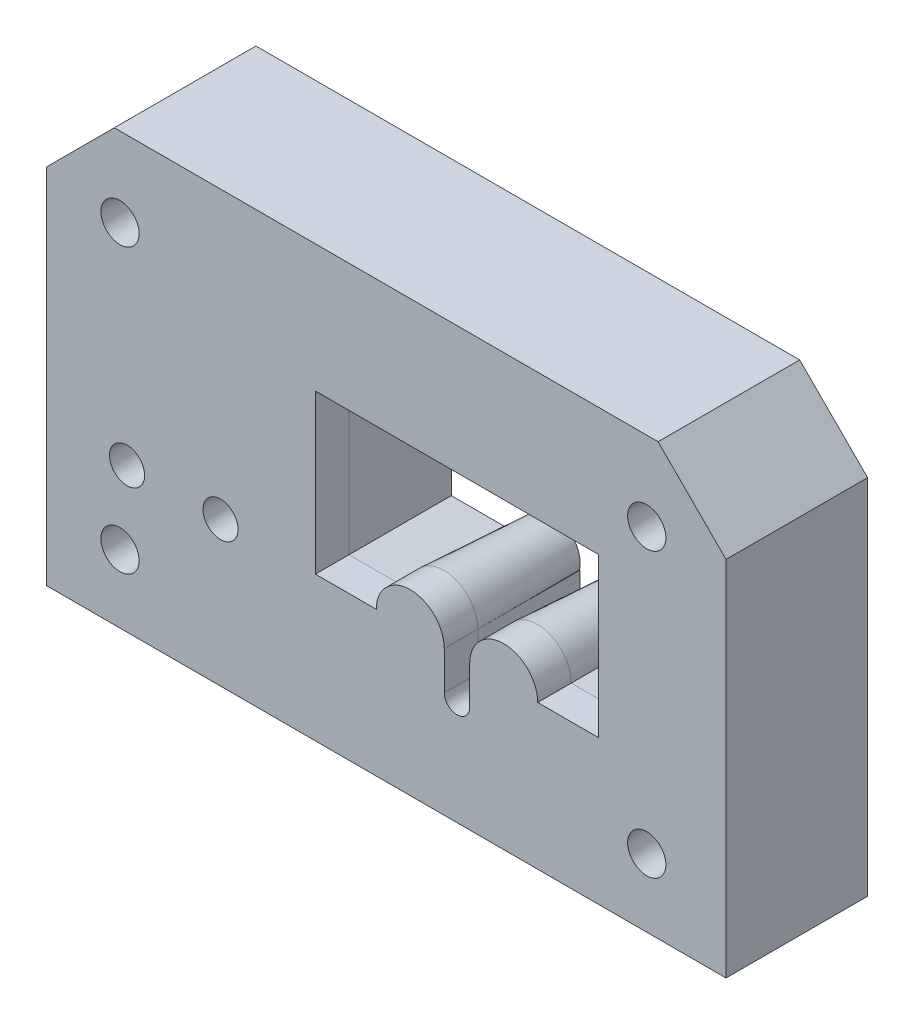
ISO-10303-21;
HEADER;
FILE_DESCRIPTION(('STEP AP214'),'2;1');
FILE_NAME('part.step','',(''),(''),'','','');
FILE_SCHEMA(('AUTOMOTIVE_DESIGN { 1 0 10303 214 1 1 1 1 }'));
ENDSEC;
DATA;
#1=APPLICATION_CONTEXT('core data for automotive mechanical design processes');
#2=APPLICATION_PROTOCOL_DEFINITION('international standard','automotive_design',2000,#1);
#3=PRODUCT_CONTEXT('',#1,'mechanical');
#4=PRODUCT('Part','Part','',(#3));
#5=PRODUCT_RELATED_PRODUCT_CATEGORY('part','',(#4));
#6=PRODUCT_DEFINITION_FORMATION('','',#4);
#7=PRODUCT_DEFINITION_CONTEXT('part definition',#1,'design');
#8=PRODUCT_DEFINITION('design','',#6,#7);
#9=PRODUCT_DEFINITION_SHAPE('','',#8);
#10=(LENGTH_UNIT() NAMED_UNIT(*) SI_UNIT(.MILLI.,.METRE.));
#11=(NAMED_UNIT(*) PLANE_ANGLE_UNIT() SI_UNIT($,.RADIAN.));
#12=(NAMED_UNIT(*) SI_UNIT($,.STERADIAN.) SOLID_ANGLE_UNIT());
#13=UNCERTAINTY_MEASURE_WITH_UNIT(LENGTH_MEASURE(1.E-05),#10,'distance_accuracy_value','');
#14=(GEOMETRIC_REPRESENTATION_CONTEXT(3) GLOBAL_UNCERTAINTY_ASSIGNED_CONTEXT((#13)) GLOBAL_UNIT_ASSIGNED_CONTEXT((#10,
#11,#12)) REPRESENTATION_CONTEXT('',''));
#15=CARTESIAN_POINT('',(0.,0.,0.));
#16=DIRECTION('',(0.,0.,1.));
#17=DIRECTION('',(1.,0.,0.));
#18=AXIS2_PLACEMENT_3D('',#15,#16,#17);
#19=CARTESIAN_POINT('',(280.851020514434,147.5,0.));
#20=DIRECTION('',(0.,-0.998629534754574,0.0523359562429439));
#21=DIRECTION('',(0.,-0.052335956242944,-0.998629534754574));
#22=AXIS2_PLACEMENT_3D('',#19,#20,#21);
#23=PLANE('',#22);
#24=DIRECTION('',(-1.,0.,0.));
#25=VECTOR('',#24,1.);
#26=CARTESIAN_POINT('',(280.851020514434,147.5,0.));
#27=LINE('',#26,#25);
#28=CARTESIAN_POINT('',(280.851020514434,147.5,0.));
#29=VERTEX_POINT('',#28);
#30=CARTESIAN_POINT('',(280.75,147.5,0.));
#31=VERTEX_POINT('',#30);
#32=EDGE_CURVE('E282',#29,#31,#27,.T.);
#33=ORIENTED_EDGE('',*,*,#32,.T.);
#34=DIRECTION('',(-0.0522644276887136,0.0522644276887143,0.997264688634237));
#35=VECTOR('',#34,1.);
#36=CARTESIAN_POINT('',(280.750275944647,147.499724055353,-0.00526533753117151));
#37=LINE('',#36,#35);
#38=CARTESIAN_POINT('',(279.75,148.5,19.0811366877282));
#39=VERTEX_POINT('',#38);
#40=EDGE_CURVE('E554',#31,#39,#37,.T.);
#41=ORIENTED_EDGE('',*,*,#40,.T.);
#42=CARTESIAN_POINT('',(279.44743434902,148.810194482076,25.));
#43=CARTESIAN_POINT('',(279.546936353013,148.705714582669,23.0064047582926));
#44=CARTESIAN_POINT('',(279.648714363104,148.601240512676,21.0129207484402));
#45=CARTESIAN_POINT('',(279.85773827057,148.392308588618,17.026262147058));
#46=CARTESIAN_POINT('',(279.964984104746,148.287850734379,15.0330875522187));
#47=CARTESIAN_POINT('',(280.195883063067,148.069475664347,10.8662429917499));
#48=CARTESIAN_POINT('',(280.320141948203,147.955560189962,8.69260625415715));
#49=CARTESIAN_POINT('',(280.51352756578,147.784707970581,5.43255170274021));
#50=CARTESIAN_POINT('',(280.579156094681,147.727760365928,4.34592667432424));
#51=CARTESIAN_POINT('',(280.713042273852,147.613873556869,2.17283690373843));
#52=CARTESIAN_POINT('',(280.781299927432,147.556934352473,1.08637216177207));
#53=CARTESIAN_POINT('',(280.851020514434,147.5,0.));
#54=B_SPLINE_CURVE_WITH_KNOTS('',3,(#42,#43,#44,#45,#46,#47,#48,#49,#50,#51,#52,#53),
.UNSPECIFIED.,.F.,.F.,(4,2,2,2,2,4),(0.,5.99642941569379,11.9927895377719,18.5332620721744,
21.8035401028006,25.0738222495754),.UNSPECIFIED.);
#55=EDGE_CURVE('E294',#39,#29,#54,.T.);
#56=ORIENTED_EDGE('',*,*,#55,.T.);
#57=EDGE_LOOP('',(#33,#41,#56));
#58=FACE_BOUND('',#57,.T.);
#59=ADVANCED_FACE('F45',(#58),#23,.F.);
#60=CARTESIAN_POINT('',(205.,123.,25.));
#61=DIRECTION('',(0.,0.,-1.));
#62=DIRECTION('',(-1.,0.,0.));
#63=AXIS2_PLACEMENT_3D('',#60,#61,#62);
#64=PLANE('',#63);
#65=CARTESIAN_POINT('',(218.,185.,25.));
#66=DIRECTION('',(0.,0.,-1.));
#67=DIRECTION('',(-1.,0.,0.));
#68=AXIS2_PLACEMENT_3D('',#65,#66,#67);
#69=CIRCLE('',#68,3.37500000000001);
#70=CARTESIAN_POINT('',(214.625,185.,25.));
#71=VERTEX_POINT('',#70);
#72=EDGE_CURVE('E240',#71,#71,#69,.T.);
#73=ORIENTED_EDGE('',*,*,#72,.T.);
#74=EDGE_LOOP('',(#73));
#75=FACE_BOUND('',#74,.T.);
#76=CARTESIAN_POINT('',(218.,135.,25.));
#77=DIRECTION('',(0.,0.,-1.));
#78=DIRECTION('',(-1.,0.,0.));
#79=AXIS2_PLACEMENT_3D('',#76,#77,#78);
#80=CIRCLE('',#79,3.37500000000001);
#81=CARTESIAN_POINT('',(214.625,135.,25.));
#82=VERTEX_POINT('',#81);
#83=EDGE_CURVE('E246',#82,#82,#80,.T.);
#84=ORIENTED_EDGE('',*,*,#83,.T.);
#85=EDGE_LOOP('',(#84));
#86=FACE_BOUND('',#85,.T.);
#87=CARTESIAN_POINT('',(311.,185.,25.));
#88=DIRECTION('',(0.,0.,-1.));
#89=DIRECTION('',(-1.,0.,0.));
#90=AXIS2_PLACEMENT_3D('',#87,#88,#89);
#91=CIRCLE('',#90,3.37500000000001);
#92=CARTESIAN_POINT('',(307.625,185.,25.));
#93=VERTEX_POINT('',#92);
#94=EDGE_CURVE('E252',#93,#93,#91,.T.);
#95=ORIENTED_EDGE('',*,*,#94,.T.);
#96=EDGE_LOOP('',(#95));
#97=FACE_BOUND('',#96,.T.);
#98=CARTESIAN_POINT('',(311.,135.,25.));
#99=DIRECTION('',(0.,0.,-1.));
#100=DIRECTION('',(-1.,0.,0.));
#101=AXIS2_PLACEMENT_3D('',#98,#99,#100);
#102=CIRCLE('',#101,3.37500000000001);
#103=CARTESIAN_POINT('',(307.625,135.,25.));
#104=VERTEX_POINT('',#103);
#105=EDGE_CURVE('E258',#104,#104,#102,.T.);
#106=ORIENTED_EDGE('',*,*,#105,.T.);
#107=EDGE_LOOP('',(#106));
#108=FACE_BOUND('',#107,.T.);
#109=CARTESIAN_POINT('',(219.25,148.5,25.));
#110=DIRECTION('',(0.,0.,1.));
#111=DIRECTION('',(1.,0.,0.));
#112=AXIS2_PLACEMENT_3D('',#109,#110,#111);
#113=CIRCLE('',#112,3.09999999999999);
#114=CARTESIAN_POINT('',(222.35,148.5,25.));
#115=VERTEX_POINT('',#114);
#116=EDGE_CURVE('E355',#115,#115,#113,.T.);
#117=ORIENTED_EDGE('',*,*,#116,.F.);
#118=EDGE_LOOP('',(#117));
#119=FACE_BOUND('',#118,.T.);
#120=DIRECTION('',(-1.,0.,0.));
#121=VECTOR('',#120,1.);
#122=CARTESIAN_POINT('',(325.,199.,25.));
#123=LINE('',#122,#121);
#124=CARTESIAN_POINT('',(313.,199.,25.));
#125=VERTEX_POINT('',#124);
#126=CARTESIAN_POINT('',(217.,199.,25.));
#127=VERTEX_POINT('',#126);
#128=EDGE_CURVE('E415',#125,#127,#123,.T.);
#129=ORIENTED_EDGE('',*,*,#128,.T.);
#130=DIRECTION('',(0.707106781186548,0.707106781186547,0.));
#131=VECTOR('',#130,1.);
#132=CARTESIAN_POINT('',(205.,187.,25.));
#133=LINE('',#132,#131);
#134=CARTESIAN_POINT('',(205.,187.,25.));
#135=VERTEX_POINT('',#134);
#136=EDGE_CURVE('E440',#127,#135,#133,.F.);
#137=ORIENTED_EDGE('',*,*,#136,.T.);
#138=DIRECTION('',(0.,-1.,0.));
#139=VECTOR('',#138,1.);
#140=CARTESIAN_POINT('',(205.,123.,25.));
#141=LINE('',#140,#139);
#142=CARTESIAN_POINT('',(205.,123.,25.));
#143=VERTEX_POINT('',#142);
#144=EDGE_CURVE('E418',#135,#143,#141,.T.);
#145=ORIENTED_EDGE('',*,*,#144,.T.);
#146=DIRECTION('',(1.,0.,0.));
#147=VECTOR('',#146,1.);
#148=CARTESIAN_POINT('',(325.,123.,25.));
#149=LINE('',#148,#147);
#150=CARTESIAN_POINT('',(325.,123.,25.));
#151=VERTEX_POINT('',#150);
#152=EDGE_CURVE('E409',#143,#151,#149,.T.);
#153=ORIENTED_EDGE('',*,*,#152,.T.);
#154=DIRECTION('',(0.,1.,0.));
#155=VECTOR('',#154,1.);
#156=CARTESIAN_POINT('',(325.,123.,25.));
#157=LINE('',#156,#155);
#158=CARTESIAN_POINT('',(325.,187.,25.));
#159=VERTEX_POINT('',#158);
#160=EDGE_CURVE('E412',#151,#159,#157,.T.);
#161=ORIENTED_EDGE('',*,*,#160,.T.);
#162=DIRECTION('',(0.707106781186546,-0.707106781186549,0.));
#163=VECTOR('',#162,1.);
#164=CARTESIAN_POINT('',(313.,199.,25.));
#165=LINE('',#164,#163);
#166=EDGE_CURVE('E438',#159,#125,#165,.F.);
#167=ORIENTED_EDGE('',*,*,#166,.T.);
#168=EDGE_LOOP('',(#129,#137,#145,#153,#161,#167));
#169=FACE_BOUND('',#168,.T.);
#170=CARTESIAN_POINT('',(277.5,141.75,25.));
#171=DIRECTION('',(0.,0.,1.));
#172=DIRECTION('',(1.,0.,0.));
#173=AXIS2_PLACEMENT_3D('',#170,#171,#172);
#174=CIRCLE('',#173,2.24999999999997);
#175=CARTESIAN_POINT('',(275.25,141.75,25.));
#176=VERTEX_POINT('',#175);
#177=CARTESIAN_POINT('',(279.75,141.75,25.));
#178=VERTEX_POINT('',#177);
#179=EDGE_CURVE('E553',#176,#178,#174,.T.);
#180=ORIENTED_EDGE('',*,*,#179,.F.);
#181=DIRECTION('',(0.,-1.,0.));
#182=VECTOR('',#181,1.);
#183=CARTESIAN_POINT('',(275.25,148.5,25.));
#184=LINE('',#183,#182);
#185=CARTESIAN_POINT('',(275.25,148.5,25.));
#186=VERTEX_POINT('',#185);
#187=EDGE_CURVE('E223',#186,#176,#184,.T.);
#188=ORIENTED_EDGE('',*,*,#187,.F.);
#189=CARTESIAN_POINT('',(269.25,148.5,25.));
#190=DIRECTION('',(0.,0.,-1.));
#191=DIRECTION('',(1.,0.,0.));
#192=AXIS2_PLACEMENT_3D('',#189,#190,#191);
#193=CIRCLE('',#192,6.00000000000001);
#194=CARTESIAN_POINT('',(263.25,148.5,25.));
#195=VERTEX_POINT('',#194);
#196=EDGE_CURVE('E358',#195,#186,#193,.T.);
#197=ORIENTED_EDGE('',*,*,#196,.F.);
#198=DIRECTION('',(1.,0.,0.));
#199=VECTOR('',#198,1.);
#200=CARTESIAN_POINT('',(263.25,148.5,25.));
#201=LINE('',#200,#199);
#202=CARTESIAN_POINT('',(252.5,148.5,25.));
#203=VERTEX_POINT('',#202);
#204=EDGE_CURVE('E372',#203,#195,#201,.T.);
#205=ORIENTED_EDGE('',*,*,#204,.F.);
#206=DIRECTION('',(0.,-1.,0.));
#207=VECTOR('',#206,1.);
#208=CARTESIAN_POINT('',(252.5,176.5,25.));
#209=LINE('',#208,#207);
#210=CARTESIAN_POINT('',(252.5,176.5,25.));
#211=VERTEX_POINT('',#210);
#212=EDGE_CURVE('E369',#211,#203,#209,.T.);
#213=ORIENTED_EDGE('',*,*,#212,.F.);
#214=DIRECTION('',(-1.,0.,0.));
#215=VECTOR('',#214,1.);
#216=CARTESIAN_POINT('',(302.5,176.5,25.));
#217=LINE('',#216,#215);
#218=CARTESIAN_POINT('',(302.5,176.5,25.));
#219=VERTEX_POINT('',#218);
#220=EDGE_CURVE('E367',#219,#211,#217,.T.);
#221=ORIENTED_EDGE('',*,*,#220,.F.);
#222=DIRECTION('',(0.,1.,0.));
#223=VECTOR('',#222,1.);
#224=CARTESIAN_POINT('',(302.5,176.5,25.));
#225=LINE('',#224,#223);
#226=CARTESIAN_POINT('',(302.5,148.5,25.));
#227=VERTEX_POINT('',#226);
#228=EDGE_CURVE('E365',#227,#219,#225,.T.);
#229=ORIENTED_EDGE('',*,*,#228,.F.);
#230=DIRECTION('',(1.,0.,0.));
#231=VECTOR('',#230,1.);
#232=CARTESIAN_POINT('',(302.5,148.5,25.));
#233=LINE('',#232,#231);
#234=CARTESIAN_POINT('',(291.75,148.5,25.));
#235=VERTEX_POINT('',#234);
#236=EDGE_CURVE('E363',#235,#227,#233,.T.);
#237=ORIENTED_EDGE('',*,*,#236,.F.);
#238=CARTESIAN_POINT('',(285.75,148.5,25.));
#239=DIRECTION('',(0.,0.,-1.));
#240=DIRECTION('',(1.,0.,0.));
#241=AXIS2_PLACEMENT_3D('',#238,#239,#240);
#242=CIRCLE('',#241,6.00000000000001);
#243=CARTESIAN_POINT('',(279.75,148.5,25.));
#244=VERTEX_POINT('',#243);
#245=EDGE_CURVE('E361',#244,#235,#242,.T.);
#246=ORIENTED_EDGE('',*,*,#245,.F.);
#247=DIRECTION('',(0.,1.,0.));
#248=VECTOR('',#247,1.);
#249=CARTESIAN_POINT('',(279.75,148.5,25.));
#250=LINE('',#249,#248);
#251=EDGE_CURVE('E217',#178,#244,#250,.T.);
#252=ORIENTED_EDGE('',*,*,#251,.F.);
#253=EDGE_LOOP('',(#180,#188,#197,#205,#213,#221,#229,#237,#246,#252));
#254=FACE_BOUND('',#253,.T.);
#255=CARTESIAN_POINT('',(235.75,148.5,25.));
#256=DIRECTION('',(0.,0.,1.));
#257=DIRECTION('',(1.,0.,0.));
#258=AXIS2_PLACEMENT_3D('',#255,#256,#257);
#259=CIRCLE('',#258,3.09999999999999);
#260=CARTESIAN_POINT('',(238.85,148.5,25.));
#261=VERTEX_POINT('',#260);
#262=EDGE_CURVE('E352',#261,#261,#259,.T.);
#263=ORIENTED_EDGE('',*,*,#262,.F.);
#264=EDGE_LOOP('',(#263));
#265=FACE_BOUND('',#264,.T.);
#266=ADVANCED_FACE('F456',(#75,#86,#97,#108,#119,#169,#254,#265),#64,.F.);
#267=CARTESIAN_POINT('',(205.,123.,0.));
#268=DIRECTION('',(0.,0.,-1.));
#269=DIRECTION('',(-1.,0.,0.));
#270=AXIS2_PLACEMENT_3D('',#267,#268,#269);
#271=PLANE('',#270);
#272=DIRECTION('',(0.,1.,0.));
#273=VECTOR('',#272,1.);
#274=CARTESIAN_POINT('',(280.75,141.75,0.));
#275=LINE('',#274,#273);
#276=CARTESIAN_POINT('',(280.75,141.75,0.));
#277=VERTEX_POINT('',#276);
#278=EDGE_CURVE('E207',#277,#31,#275,.T.);
#279=ORIENTED_EDGE('',*,*,#278,.T.);
#280=ORIENTED_EDGE('',*,*,#32,.F.);
#281=CARTESIAN_POINT('',(285.75,148.5,0.));
#282=DIRECTION('',(0.,0.,1.));
#283=DIRECTION('',(-1.,0.,0.));
#284=AXIS2_PLACEMENT_3D('',#281,#282,#283);
#285=CIRCLE('',#284,4.99999999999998);
#286=CARTESIAN_POINT('',(290.648979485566,147.5,0.));
#287=VERTEX_POINT('',#286);
#288=EDGE_CURVE('E279',#287,#29,#285,.T.);
#289=ORIENTED_EDGE('',*,*,#288,.F.);
#290=DIRECTION('',(-1.,0.,0.));
#291=VECTOR('',#290,1.);
#292=CARTESIAN_POINT('',(303.5,147.5,0.));
#293=LINE('',#292,#291);
#294=CARTESIAN_POINT('',(303.5,147.5,0.));
#295=VERTEX_POINT('',#294);
#296=EDGE_CURVE('E276',#295,#287,#293,.T.);
#297=ORIENTED_EDGE('',*,*,#296,.F.);
#298=DIRECTION('',(0.,-1.,0.));
#299=VECTOR('',#298,1.);
#300=CARTESIAN_POINT('',(303.5,177.5,0.));
#301=LINE('',#300,#299);
#302=CARTESIAN_POINT('',(303.5,177.5,0.));
#303=VERTEX_POINT('',#302);
#304=EDGE_CURVE('E273',#303,#295,#301,.T.);
#305=ORIENTED_EDGE('',*,*,#304,.F.);
#306=DIRECTION('',(1.,0.,0.));
#307=VECTOR('',#306,1.);
#308=CARTESIAN_POINT('',(251.5,177.5,0.));
#309=LINE('',#308,#307);
#310=CARTESIAN_POINT('',(251.5,177.5,0.));
#311=VERTEX_POINT('',#310);
#312=EDGE_CURVE('E270',#311,#303,#309,.T.);
#313=ORIENTED_EDGE('',*,*,#312,.F.);
#314=DIRECTION('',(0.,1.,0.));
#315=VECTOR('',#314,1.);
#316=CARTESIAN_POINT('',(251.5,147.5,0.));
#317=LINE('',#316,#315);
#318=CARTESIAN_POINT('',(251.5,147.5,0.));
#319=VERTEX_POINT('',#318);
#320=EDGE_CURVE('E267',#319,#311,#317,.T.);
#321=ORIENTED_EDGE('',*,*,#320,.F.);
#322=DIRECTION('',(-1.,0.,0.));
#323=VECTOR('',#322,1.);
#324=CARTESIAN_POINT('',(264.351020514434,147.5,0.));
#325=LINE('',#324,#323);
#326=CARTESIAN_POINT('',(264.351020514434,147.5,0.));
#327=VERTEX_POINT('',#326);
#328=EDGE_CURVE('E265',#327,#319,#325,.T.);
#329=ORIENTED_EDGE('',*,*,#328,.F.);
#330=CARTESIAN_POINT('',(269.25,148.5,0.));
#331=DIRECTION('',(0.,0.,1.));
#332=DIRECTION('',(-1.,0.,0.));
#333=AXIS2_PLACEMENT_3D('',#330,#331,#332);
#334=CIRCLE('',#333,5.00000000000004);
#335=CARTESIAN_POINT('',(274.148979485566,147.5,0.));
#336=VERTEX_POINT('',#335);
#337=EDGE_CURVE('E61',#336,#327,#334,.T.);
#338=ORIENTED_EDGE('',*,*,#337,.F.);
#339=CARTESIAN_POINT('',(274.25,147.5,0.));
#340=VERTEX_POINT('',#339);
#341=EDGE_CURVE('E281',#340,#336,#27,.T.);
#342=ORIENTED_EDGE('',*,*,#341,.F.);
#343=DIRECTION('',(0.,-1.,0.));
#344=VECTOR('',#343,1.);
#345=CARTESIAN_POINT('',(274.25,141.75,0.));
#346=LINE('',#345,#344);
#347=CARTESIAN_POINT('',(274.25,141.75,0.));
#348=VERTEX_POINT('',#347);
#349=EDGE_CURVE('E601',#340,#348,#346,.T.);
#350=ORIENTED_EDGE('',*,*,#349,.T.);
#351=CARTESIAN_POINT('',(277.5,141.75,0.));
#352=DIRECTION('',(0.,0.,1.));
#353=DIRECTION('',(1.,0.,0.));
#354=AXIS2_PLACEMENT_3D('',#351,#352,#353);
#355=CIRCLE('',#354,3.24999999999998);
#356=EDGE_CURVE('E203',#348,#277,#355,.T.);
#357=ORIENTED_EDGE('',*,*,#356,.T.);
#358=EDGE_LOOP('',(#279,#280,#289,#297,#305,#313,#321,#329,#338,#342,#350,#357));
#359=FACE_BOUND('',#358,.T.);
#360=CARTESIAN_POINT('',(218.,185.,0.));
#361=DIRECTION('',(0.,0.,-1.));
#362=DIRECTION('',(-1.,0.,0.));
#363=AXIS2_PLACEMENT_3D('',#360,#361,#362);
#364=CIRCLE('',#363,3.37500000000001);
#365=CARTESIAN_POINT('',(214.625,185.,0.));
#366=VERTEX_POINT('',#365);
#367=EDGE_CURVE('E236',#366,#366,#364,.T.);
#368=ORIENTED_EDGE('',*,*,#367,.F.);
#369=EDGE_LOOP('',(#368));
#370=FACE_BOUND('',#369,.T.);
#371=CARTESIAN_POINT('',(218.,135.,0.));
#372=DIRECTION('',(0.,0.,-1.));
#373=DIRECTION('',(-1.,0.,0.));
#374=AXIS2_PLACEMENT_3D('',#371,#372,#373);
#375=CIRCLE('',#374,3.37500000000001);
#376=CARTESIAN_POINT('',(214.625,135.,0.));
#377=VERTEX_POINT('',#376);
#378=EDGE_CURVE('E243',#377,#377,#375,.T.);
#379=ORIENTED_EDGE('',*,*,#378,.F.);
#380=EDGE_LOOP('',(#379));
#381=FACE_BOUND('',#380,.T.);
#382=CARTESIAN_POINT('',(311.,185.,0.));
#383=DIRECTION('',(0.,0.,-1.));
#384=DIRECTION('',(-1.,0.,0.));
#385=AXIS2_PLACEMENT_3D('',#382,#383,#384);
#386=CIRCLE('',#385,3.37500000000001);
#387=CARTESIAN_POINT('',(307.625,185.,0.));
#388=VERTEX_POINT('',#387);
#389=EDGE_CURVE('E249',#388,#388,#386,.T.);
#390=ORIENTED_EDGE('',*,*,#389,.F.);
#391=EDGE_LOOP('',(#390));
#392=FACE_BOUND('',#391,.T.);
#393=CARTESIAN_POINT('',(311.,135.,0.));
#394=DIRECTION('',(0.,0.,-1.));
#395=DIRECTION('',(-1.,0.,0.));
#396=AXIS2_PLACEMENT_3D('',#393,#394,#395);
#397=CIRCLE('',#396,3.37500000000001);
#398=CARTESIAN_POINT('',(307.625,135.,0.));
#399=VERTEX_POINT('',#398);
#400=EDGE_CURVE('E255',#399,#399,#397,.T.);
#401=ORIENTED_EDGE('',*,*,#400,.F.);
#402=EDGE_LOOP('',(#401));
#403=FACE_BOUND('',#402,.T.);
#404=CARTESIAN_POINT('',(219.25,148.5,0.));
#405=DIRECTION('',(0.,0.,-1.));
#406=DIRECTION('',(-1.,0.,0.));
#407=AXIS2_PLACEMENT_3D('',#404,#405,#406);
#408=CIRCLE('',#407,4.09999999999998);
#409=CARTESIAN_POINT('',(215.15,148.5,0.));
#410=VERTEX_POINT('',#409);
#411=EDGE_CURVE('E261',#410,#410,#408,.T.);
#412=ORIENTED_EDGE('',*,*,#411,.F.);
#413=EDGE_LOOP('',(#412));
#414=FACE_BOUND('',#413,.T.);
#415=CARTESIAN_POINT('',(235.75,148.5,0.));
#416=DIRECTION('',(0.,0.,-1.));
#417=DIRECTION('',(-1.,0.,0.));
#418=AXIS2_PLACEMENT_3D('',#415,#416,#417);
#419=CIRCLE('',#418,4.09999999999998);
#420=CARTESIAN_POINT('',(231.65,148.5,0.));
#421=VERTEX_POINT('',#420);
#422=EDGE_CURVE('E348',#421,#421,#419,.T.);
#423=ORIENTED_EDGE('',*,*,#422,.F.);
#424=EDGE_LOOP('',(#423));
#425=FACE_BOUND('',#424,.T.);
#426=DIRECTION('',(0.,-1.,0.));
#427=VECTOR('',#426,1.);
#428=CARTESIAN_POINT('',(205.,123.,0.));
#429=LINE('',#428,#427);
#430=CARTESIAN_POINT('',(205.,187.,0.));
#431=VERTEX_POINT('',#430);
#432=CARTESIAN_POINT('',(205.,123.,0.));
#433=VERTEX_POINT('',#432);
#434=EDGE_CURVE('E407',#431,#433,#429,.T.);
#435=ORIENTED_EDGE('',*,*,#434,.F.);
#436=DIRECTION('',(-0.707106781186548,-0.707106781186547,0.));
#437=VECTOR('',#436,1.);
#438=CARTESIAN_POINT('',(173.,155.,0.));
#439=LINE('',#438,#437);
#440=CARTESIAN_POINT('',(217.,199.,0.));
#441=VERTEX_POINT('',#440);
#442=EDGE_CURVE('E431',#431,#441,#439,.F.);
#443=ORIENTED_EDGE('',*,*,#442,.T.);
#444=DIRECTION('',(-1.,0.,0.));
#445=VECTOR('',#444,1.);
#446=CARTESIAN_POINT('',(325.,199.,0.));
#447=LINE('',#446,#445);
#448=CARTESIAN_POINT('',(313.,199.,0.));
#449=VERTEX_POINT('',#448);
#450=EDGE_CURVE('E404',#449,#441,#447,.T.);
#451=ORIENTED_EDGE('',*,*,#450,.F.);
#452=DIRECTION('',(-0.707106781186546,0.707106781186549,0.));
#453=VECTOR('',#452,1.);
#454=CARTESIAN_POINT('',(297.,215.,0.));
#455=LINE('',#454,#453);
#456=CARTESIAN_POINT('',(325.,187.,0.));
#457=VERTEX_POINT('',#456);
#458=EDGE_CURVE('E429',#449,#457,#455,.F.);
#459=ORIENTED_EDGE('',*,*,#458,.T.);
#460=DIRECTION('',(0.,1.,0.));
#461=VECTOR('',#460,1.);
#462=CARTESIAN_POINT('',(325.,123.,0.));
#463=LINE('',#462,#461);
#464=CARTESIAN_POINT('',(325.,123.,0.));
#465=VERTEX_POINT('',#464);
#466=EDGE_CURVE('E401',#465,#457,#463,.T.);
#467=ORIENTED_EDGE('',*,*,#466,.F.);
#468=DIRECTION('',(1.,0.,0.));
#469=VECTOR('',#468,1.);
#470=CARTESIAN_POINT('',(325.,123.,0.));
#471=LINE('',#470,#469);
#472=EDGE_CURVE('E398',#433,#465,#471,.T.);
#473=ORIENTED_EDGE('',*,*,#472,.F.);
#474=EDGE_LOOP('',(#435,#443,#451,#459,#467,#473));
#475=FACE_BOUND('',#474,.T.);
#476=ADVANCED_FACE('F458',(#359,#370,#381,#392,#403,#414,#425,#475),#271,.T.);
#477=CARTESIAN_POINT('',(325.,123.,25.));
#478=DIRECTION('',(0.,1.,0.));
#479=DIRECTION('',(-1.,0.,0.));
#480=AXIS2_PLACEMENT_3D('',#477,#478,#479);
#481=PLANE('',#480);
#482=ORIENTED_EDGE('',*,*,#472,.T.);
#483=DIRECTION('',(0.,0.,-1.));
#484=VECTOR('',#483,1.);
#485=CARTESIAN_POINT('',(325.,123.,25.));
#486=LINE('',#485,#484);
#487=EDGE_CURVE('E423',#151,#465,#486,.T.);
#488=ORIENTED_EDGE('',*,*,#487,.F.);
#489=ORIENTED_EDGE('',*,*,#152,.F.);
#490=DIRECTION('',(0.,0.,-1.));
#491=VECTOR('',#490,1.);
#492=CARTESIAN_POINT('',(205.,123.,25.));
#493=LINE('',#492,#491);
#494=EDGE_CURVE('E420',#143,#433,#493,.T.);
#495=ORIENTED_EDGE('',*,*,#494,.T.);
#496=EDGE_LOOP('',(#482,#488,#489,#495));
#497=FACE_BOUND('',#496,.T.);
#498=ADVANCED_FACE('F47',(#497),#481,.F.);
#499=CARTESIAN_POINT('',(325.,123.,25.));
#500=DIRECTION('',(-1.,0.,0.));
#501=DIRECTION('',(0.,0.,1.));
#502=AXIS2_PLACEMENT_3D('',#499,#500,#501);
#503=PLANE('',#502);
#504=ORIENTED_EDGE('',*,*,#466,.T.);
#505=DIRECTION('',(0.,0.,1.));
#506=VECTOR('',#505,1.);
#507=CARTESIAN_POINT('',(325.,187.,25.));
#508=LINE('',#507,#506);
#509=EDGE_CURVE('E54',#457,#159,#508,.T.);
#510=ORIENTED_EDGE('',*,*,#509,.T.);
#511=ORIENTED_EDGE('',*,*,#160,.F.);
#512=ORIENTED_EDGE('',*,*,#487,.T.);
#513=EDGE_LOOP('',(#504,#510,#511,#512));
#514=FACE_BOUND('',#513,.T.);
#515=ADVANCED_FACE('F478',(#514),#503,.F.);
#516=CARTESIAN_POINT('',(325.,199.,25.));
#517=DIRECTION('',(0.,-1.,0.));
#518=DIRECTION('',(1.,0.,0.));
#519=AXIS2_PLACEMENT_3D('',#516,#517,#518);
#520=PLANE('',#519);
#521=ORIENTED_EDGE('',*,*,#450,.T.);
#522=DIRECTION('',(0.,0.,1.));
#523=VECTOR('',#522,1.);
#524=CARTESIAN_POINT('',(217.,199.,25.));
#525=LINE('',#524,#523);
#526=EDGE_CURVE('E436',#441,#127,#525,.T.);
#527=ORIENTED_EDGE('',*,*,#526,.T.);
#528=ORIENTED_EDGE('',*,*,#128,.F.);
#529=DIRECTION('',(0.,0.,-1.));
#530=VECTOR('',#529,1.);
#531=CARTESIAN_POINT('',(313.,199.,25.));
#532=LINE('',#531,#530);
#533=EDGE_CURVE('E433',#125,#449,#532,.T.);
#534=ORIENTED_EDGE('',*,*,#533,.T.);
#535=EDGE_LOOP('',(#521,#527,#528,#534));
#536=FACE_BOUND('',#535,.T.);
#537=ADVANCED_FACE('F475',(#536),#520,.F.);
#538=CARTESIAN_POINT('',(205.,123.,25.));
#539=DIRECTION('',(1.,0.,0.));
#540=DIRECTION('',(0.,0.,-1.));
#541=AXIS2_PLACEMENT_3D('',#538,#539,#540);
#542=PLANE('',#541);
#543=ORIENTED_EDGE('',*,*,#144,.F.);
#544=DIRECTION('',(0.,0.,-1.));
#545=VECTOR('',#544,1.);
#546=CARTESIAN_POINT('',(205.,187.,25.));
#547=LINE('',#546,#545);
#548=EDGE_CURVE('E426',#135,#431,#547,.T.);
#549=ORIENTED_EDGE('',*,*,#548,.T.);
#550=ORIENTED_EDGE('',*,*,#434,.T.);
#551=ORIENTED_EDGE('',*,*,#494,.F.);
#552=EDGE_LOOP('',(#543,#549,#550,#551));
#553=FACE_BOUND('',#552,.T.);
#554=ADVANCED_FACE('F471',(#553),#542,.F.);
#555=CARTESIAN_POINT('',(269.25,148.5,25.));
#556=DIRECTION('',(0.,0.,-1.));
#557=DIRECTION('',(-1.,0.,0.));
#558=AXIS2_PLACEMENT_3D('',#555,#556,#557);
#559=CYLINDRICAL_SURFACE('',#558,6.00000000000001);
#560=CARTESIAN_POINT('',(269.25,148.5,19.0811366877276));
#561=DIRECTION('',(0.,0.,1.));
#562=DIRECTION('',(1.,0.,0.));
#563=AXIS2_PLACEMENT_3D('',#560,#561,#562);
#564=CIRCLE('',#563,6.00000000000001);
#565=CARTESIAN_POINT('',(263.25,148.5,19.0811366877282));
#566=VERTEX_POINT('',#565);
#567=CARTESIAN_POINT('',(275.25,148.5,19.0811366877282));
#568=VERTEX_POINT('',#567);
#569=EDGE_CURVE('E338',#566,#568,#564,.F.);
#570=ORIENTED_EDGE('',*,*,#569,.F.);
#571=DIRECTION('',(0.,0.,-1.));
#572=VECTOR('',#571,1.);
#573=CARTESIAN_POINT('',(263.25,148.5,25.));
#574=LINE('',#573,#572);
#575=EDGE_CURVE('E374',#195,#566,#574,.T.);
#576=ORIENTED_EDGE('',*,*,#575,.F.);
#577=ORIENTED_EDGE('',*,*,#196,.T.);
#578=DIRECTION('',(0.,0.,-1.));
#579=VECTOR('',#578,1.);
#580=CARTESIAN_POINT('',(275.25,148.5,25.));
#581=LINE('',#580,#579);
#582=EDGE_CURVE('E395',#186,#568,#581,.T.);
#583=ORIENTED_EDGE('',*,*,#582,.T.);
#584=EDGE_LOOP('',(#570,#576,#577,#583));
#585=FACE_BOUND('',#584,.T.);
#586=ADVANCED_FACE('F474',(#585),#559,.T.);
#587=CARTESIAN_POINT('',(285.75,148.5,25.));
#588=DIRECTION('',(0.,0.,-1.));
#589=DIRECTION('',(-1.,0.,0.));
#590=AXIS2_PLACEMENT_3D('',#587,#588,#589);
#591=CYLINDRICAL_SURFACE('',#590,6.00000000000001);
#592=CARTESIAN_POINT('',(285.75,148.5,19.0811366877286));
#593=DIRECTION('',(0.,0.,1.));
#594=DIRECTION('',(1.,0.,0.));
#595=AXIS2_PLACEMENT_3D('',#592,#593,#594);
#596=CIRCLE('',#595,6.00000000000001);
#597=CARTESIAN_POINT('',(291.75,148.5,19.0811366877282));
#598=VERTEX_POINT('',#597);
#599=EDGE_CURVE('E346',#39,#598,#596,.F.);
#600=ORIENTED_EDGE('',*,*,#599,.F.);
#601=DIRECTION('',(0.,0.,-1.));
#602=VECTOR('',#601,1.);
#603=CARTESIAN_POINT('',(279.75,148.5,25.));
#604=LINE('',#603,#602);
#605=EDGE_CURVE('E392',#244,#39,#604,.T.);
#606=ORIENTED_EDGE('',*,*,#605,.F.);
#607=ORIENTED_EDGE('',*,*,#245,.T.);
#608=DIRECTION('',(0.,0.,-1.));
#609=VECTOR('',#608,1.);
#610=CARTESIAN_POINT('',(291.75,148.5,25.));
#611=LINE('',#610,#609);
#612=EDGE_CURVE('E389',#235,#598,#611,.T.);
#613=ORIENTED_EDGE('',*,*,#612,.T.);
#614=EDGE_LOOP('',(#600,#606,#607,#613));
#615=FACE_BOUND('',#614,.T.);
#616=ADVANCED_FACE('F536',(#615),#591,.T.);
#617=CARTESIAN_POINT('',(302.5,148.5,25.));
#618=DIRECTION('',(0.,1.,0.));
#619=DIRECTION('',(0.,0.,1.));
#620=AXIS2_PLACEMENT_3D('',#617,#618,#619);
#621=PLANE('',#620);
#622=DIRECTION('',(1.,0.,0.));
#623=VECTOR('',#622,1.);
#624=CARTESIAN_POINT('',(302.5,148.5,19.0811366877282));
#625=LINE('',#624,#623);
#626=CARTESIAN_POINT('',(302.5,148.5,19.0811366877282));
#627=VERTEX_POINT('',#626);
#628=EDGE_CURVE('E344',#598,#627,#625,.T.);
#629=ORIENTED_EDGE('',*,*,#628,.F.);
#630=ORIENTED_EDGE('',*,*,#612,.F.);
#631=ORIENTED_EDGE('',*,*,#236,.T.);
#632=DIRECTION('',(0.,0.,-1.));
#633=VECTOR('',#632,1.);
#634=CARTESIAN_POINT('',(302.5,148.5,25.));
#635=LINE('',#634,#633);
#636=EDGE_CURVE('E386',#227,#627,#635,.T.);
#637=ORIENTED_EDGE('',*,*,#636,.T.);
#638=EDGE_LOOP('',(#629,#630,#631,#637));
#639=FACE_BOUND('',#638,.T.);
#640=ADVANCED_FACE('F532',(#639),#621,.T.);
#641=CARTESIAN_POINT('',(302.5,176.5,25.));
#642=DIRECTION('',(-1.,0.,0.));
#643=DIRECTION('',(0.,0.,1.));
#644=AXIS2_PLACEMENT_3D('',#641,#642,#643);
#645=PLANE('',#644);
#646=DIRECTION('',(0.,1.,0.));
#647=VECTOR('',#646,1.);
#648=CARTESIAN_POINT('',(302.5,176.5,19.0811366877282));
#649=LINE('',#648,#647);
#650=CARTESIAN_POINT('',(302.5,176.5,19.0811366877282));
#651=VERTEX_POINT('',#650);
#652=EDGE_CURVE('E342',#627,#651,#649,.T.);
#653=ORIENTED_EDGE('',*,*,#652,.F.);
#654=ORIENTED_EDGE('',*,*,#636,.F.);
#655=ORIENTED_EDGE('',*,*,#228,.T.);
#656=DIRECTION('',(0.,0.,-1.));
#657=VECTOR('',#656,1.);
#658=CARTESIAN_POINT('',(302.5,176.5,25.));
#659=LINE('',#658,#657);
#660=EDGE_CURVE('E383',#219,#651,#659,.T.);
#661=ORIENTED_EDGE('',*,*,#660,.T.);
#662=EDGE_LOOP('',(#653,#654,#655,#661));
#663=FACE_BOUND('',#662,.T.);
#664=ADVANCED_FACE('F528',(#663),#645,.T.);
#665=CARTESIAN_POINT('',(302.5,176.5,25.));
#666=DIRECTION('',(0.,-1.,0.));
#667=DIRECTION('',(1.,0.,0.));
#668=AXIS2_PLACEMENT_3D('',#665,#666,#667);
#669=PLANE('',#668);
#670=DIRECTION('',(-1.,0.,0.));
#671=VECTOR('',#670,1.);
#672=CARTESIAN_POINT('',(302.5,176.5,19.0811366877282));
#673=LINE('',#672,#671);
#674=CARTESIAN_POINT('',(252.5,176.5,19.0811366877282));
#675=VERTEX_POINT('',#674);
#676=EDGE_CURVE('E340',#651,#675,#673,.T.);
#677=ORIENTED_EDGE('',*,*,#676,.F.);
#678=ORIENTED_EDGE('',*,*,#660,.F.);
#679=ORIENTED_EDGE('',*,*,#220,.T.);
#680=DIRECTION('',(0.,0.,-1.));
#681=VECTOR('',#680,1.);
#682=CARTESIAN_POINT('',(252.5,176.5,25.));
#683=LINE('',#682,#681);
#684=EDGE_CURVE('E380',#211,#675,#683,.T.);
#685=ORIENTED_EDGE('',*,*,#684,.T.);
#686=EDGE_LOOP('',(#677,#678,#679,#685));
#687=FACE_BOUND('',#686,.T.);
#688=ADVANCED_FACE('F524',(#687),#669,.T.);
#689=CARTESIAN_POINT('',(252.5,176.5,25.));
#690=DIRECTION('',(1.,0.,0.));
#691=DIRECTION('',(0.,0.,-1.));
#692=AXIS2_PLACEMENT_3D('',#689,#690,#691);
#693=PLANE('',#692);
#694=DIRECTION('',(0.,-1.,0.));
#695=VECTOR('',#694,1.);
#696=CARTESIAN_POINT('',(252.5,176.5,19.0811366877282));
#697=LINE('',#696,#695);
#698=CARTESIAN_POINT('',(252.5,148.5,19.0811366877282));
#699=VERTEX_POINT('',#698);
#700=EDGE_CURVE('E293',#675,#699,#697,.T.);
#701=ORIENTED_EDGE('',*,*,#700,.F.);
#702=ORIENTED_EDGE('',*,*,#684,.F.);
#703=ORIENTED_EDGE('',*,*,#212,.T.);
#704=DIRECTION('',(0.,0.,-1.));
#705=VECTOR('',#704,1.);
#706=CARTESIAN_POINT('',(252.5,148.5,25.));
#707=LINE('',#706,#705);
#708=EDGE_CURVE('E377',#203,#699,#707,.T.);
#709=ORIENTED_EDGE('',*,*,#708,.T.);
#710=EDGE_LOOP('',(#701,#702,#703,#709));
#711=FACE_BOUND('',#710,.T.);
#712=ADVANCED_FACE('F520',(#711),#693,.T.);
#713=CARTESIAN_POINT('',(263.25,148.5,25.));
#714=DIRECTION('',(0.,1.,0.));
#715=DIRECTION('',(0.,0.,1.));
#716=AXIS2_PLACEMENT_3D('',#713,#714,#715);
#717=PLANE('',#716);
#718=DIRECTION('',(1.,0.,0.));
#719=VECTOR('',#718,1.);
#720=CARTESIAN_POINT('',(263.25,148.5,19.0811366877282));
#721=LINE('',#720,#719);
#722=EDGE_CURVE('E13',#699,#566,#721,.T.);
#723=ORIENTED_EDGE('',*,*,#722,.F.);
#724=ORIENTED_EDGE('',*,*,#708,.F.);
#725=ORIENTED_EDGE('',*,*,#204,.T.);
#726=ORIENTED_EDGE('',*,*,#575,.T.);
#727=EDGE_LOOP('',(#723,#724,#725,#726));
#728=FACE_BOUND('',#727,.T.);
#729=ADVANCED_FACE('F516',(#728),#717,.T.);
#730=CARTESIAN_POINT('',(219.25,148.5,25.));
#731=DIRECTION('',(0.,0.,-1.));
#732=DIRECTION('',(-1.,0.,0.));
#733=AXIS2_PLACEMENT_3D('',#730,#731,#732);
#734=CYLINDRICAL_SURFACE('',#733,3.09999999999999);
#735=CARTESIAN_POINT('',(219.25,148.5,19.0811366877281));
#736=DIRECTION('',(0.,0.,-1.));
#737=DIRECTION('',(-1.,0.,0.));
#738=AXIS2_PLACEMENT_3D('',#735,#736,#737);
#739=CIRCLE('',#738,3.09999999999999);
#740=CARTESIAN_POINT('',(216.15,148.5,19.0811366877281));
#741=VERTEX_POINT('',#740);
#742=EDGE_CURVE('E49',#741,#741,#739,.F.);
#743=ORIENTED_EDGE('',*,*,#742,.F.);
#744=EDGE_LOOP('',(#743));
#745=FACE_BOUND('',#744,.T.);
#746=ORIENTED_EDGE('',*,*,#116,.T.);
#747=EDGE_LOOP('',(#746));
#748=FACE_BOUND('',#747,.T.);
#749=ADVANCED_FACE('F452',(#745,#748),#734,.F.);
#750=CARTESIAN_POINT('',(235.75,148.5,25.));
#751=DIRECTION('',(0.,0.,-1.));
#752=DIRECTION('',(-1.,0.,0.));
#753=AXIS2_PLACEMENT_3D('',#750,#751,#752);
#754=CYLINDRICAL_SURFACE('',#753,3.09999999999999);
#755=CARTESIAN_POINT('',(235.75,148.5,19.0811366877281));
#756=DIRECTION('',(0.,0.,-1.));
#757=DIRECTION('',(-1.,0.,0.));
#758=AXIS2_PLACEMENT_3D('',#755,#756,#757);
#759=CIRCLE('',#758,3.09999999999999);
#760=CARTESIAN_POINT('',(232.65,148.5,19.0811366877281));
#761=VERTEX_POINT('',#760);
#762=EDGE_CURVE('E351',#761,#761,#759,.F.);
#763=ORIENTED_EDGE('',*,*,#762,.F.);
#764=EDGE_LOOP('',(#763));
#765=FACE_BOUND('',#764,.T.);
#766=ORIENTED_EDGE('',*,*,#262,.T.);
#767=EDGE_LOOP('',(#766));
#768=FACE_BOUND('',#767,.T.);
#769=ADVANCED_FACE('F448',(#765,#768),#754,.F.);
#770=CARTESIAN_POINT('',(205.,187.,25.));
#771=DIRECTION('',(0.707106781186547,-0.707106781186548,0.));
#772=DIRECTION('',(0.707106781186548,0.707106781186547,0.));
#773=AXIS2_PLACEMENT_3D('',#770,#771,#772);
#774=PLANE('',#773);
#775=ORIENTED_EDGE('',*,*,#136,.F.);
#776=ORIENTED_EDGE('',*,*,#526,.F.);
#777=ORIENTED_EDGE('',*,*,#442,.F.);
#778=ORIENTED_EDGE('',*,*,#548,.F.);
#779=EDGE_LOOP('',(#775,#776,#777,#778));
#780=FACE_BOUND('',#779,.T.);
#781=ADVANCED_FACE('F451',(#780),#774,.F.);
#782=CARTESIAN_POINT('',(313.,199.,25.));
#783=DIRECTION('',(-0.707106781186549,-0.707106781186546,0.));
#784=DIRECTION('',(0.707106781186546,-0.707106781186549,0.));
#785=AXIS2_PLACEMENT_3D('',#782,#783,#784);
#786=PLANE('',#785);
#787=ORIENTED_EDGE('',*,*,#166,.F.);
#788=ORIENTED_EDGE('',*,*,#509,.F.);
#789=ORIENTED_EDGE('',*,*,#458,.F.);
#790=ORIENTED_EDGE('',*,*,#533,.F.);
#791=EDGE_LOOP('',(#787,#788,#789,#790));
#792=FACE_BOUND('',#791,.T.);
#793=ADVANCED_FACE('F492',(#792),#786,.F.);
#794=CARTESIAN_POINT('',(235.75,148.5,0.));
#795=DIRECTION('',(0.,0.,-1.));
#796=DIRECTION('',(-1.,0.,0.));
#797=AXIS2_PLACEMENT_3D('',#794,#795,#796);
#798=CONICAL_SURFACE('',#797,4.09999999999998,0.05235987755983);
#799=ORIENTED_EDGE('',*,*,#762,.T.);
#800=EDGE_LOOP('',(#799));
#801=FACE_BOUND('',#800,.T.);
#802=ORIENTED_EDGE('',*,*,#422,.T.);
#803=EDGE_LOOP('',(#802));
#804=FACE_BOUND('',#803,.T.);
#805=ADVANCED_FACE('F306',(#801,#804),#798,.F.);
#806=CARTESIAN_POINT('',(269.25,148.5,0.));
#807=DIRECTION('',(0.,0.,1.));
#808=DIRECTION('',(-1.,0.,0.));
#809=AXIS2_PLACEMENT_3D('',#806,#807,#808);
#810=CONICAL_SURFACE('',#809,5.00000000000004,0.05235987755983);
#811=ORIENTED_EDGE('',*,*,#337,.T.);
#812=CARTESIAN_POINT('',(262.94743434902,148.810194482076,25.));
#813=CARTESIAN_POINT('',(263.046936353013,148.705714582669,23.0064047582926));
#814=CARTESIAN_POINT('',(263.148714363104,148.601240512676,21.0129207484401));
#815=CARTESIAN_POINT('',(263.35773827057,148.392308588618,17.0262621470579));
#816=CARTESIAN_POINT('',(263.464984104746,148.287850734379,15.0330875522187));
#817=CARTESIAN_POINT('',(263.695883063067,148.069475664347,10.8662429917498));
#818=CARTESIAN_POINT('',(263.820141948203,147.955560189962,8.69260625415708));
#819=CARTESIAN_POINT('',(264.01352756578,147.784707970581,5.43255170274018));
#820=CARTESIAN_POINT('',(264.079156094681,147.727760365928,4.34592667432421));
#821=CARTESIAN_POINT('',(264.213042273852,147.613873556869,2.17283690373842));
#822=CARTESIAN_POINT('',(264.281299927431,147.556934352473,1.08637216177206));
#823=CARTESIAN_POINT('',(264.351020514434,147.5,0.));
#824=B_SPLINE_CURVE_WITH_KNOTS('',3,(#812,#813,#814,#815,#816,#817,#818,#819,#820,#821,#822,
#823),.UNSPECIFIED.,.F.,.F.,(4,2,2,2,2,4),(0.,5.99642941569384,11.992789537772,18.5332620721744,
21.8035401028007,25.0738222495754),.UNSPECIFIED.);
#825=EDGE_CURVE('E285',#566,#327,#824,.T.);
#826=ORIENTED_EDGE('',*,*,#825,.F.);
#827=ORIENTED_EDGE('',*,*,#569,.T.);
#828=CARTESIAN_POINT('',(275.55256565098,148.810194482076,25.));
#829=CARTESIAN_POINT('',(275.453063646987,148.705714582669,23.0064047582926));
#830=CARTESIAN_POINT('',(275.351285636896,148.601240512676,21.0129207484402));
#831=CARTESIAN_POINT('',(275.14226172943,148.392308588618,17.0262621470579));
#832=CARTESIAN_POINT('',(275.035015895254,148.287850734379,15.0330875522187));
#833=CARTESIAN_POINT('',(274.804116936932,148.069475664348,10.8662429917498));
#834=CARTESIAN_POINT('',(274.679858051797,147.955560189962,8.69260625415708));
#835=CARTESIAN_POINT('',(274.48647243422,147.784707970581,5.43255170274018));
#836=CARTESIAN_POINT('',(274.420843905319,147.727760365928,4.34592667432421));
#837=CARTESIAN_POINT('',(274.286957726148,147.613873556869,2.17283690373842));
#838=CARTESIAN_POINT('',(274.218700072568,147.556934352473,1.08637216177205));
#839=CARTESIAN_POINT('',(274.148979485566,147.5,0.));
#840=B_SPLINE_CURVE_WITH_KNOTS('',3,(#828,#829,#830,#831,#832,#833,#834,#835,#836,#837,#838,
#839),.UNSPECIFIED.,.F.,.F.,(4,2,2,2,2,4),(0.,5.99642941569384,11.992789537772,18.5332620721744,
21.8035401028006,25.0738222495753),.UNSPECIFIED.);
#841=EDGE_CURVE('E286',#568,#336,#840,.T.);
#842=ORIENTED_EDGE('',*,*,#841,.T.);
#843=EDGE_LOOP('',(#811,#826,#827,#842));
#844=FACE_BOUND('',#843,.T.);
#845=ADVANCED_FACE('F303',(#844),#810,.T.);
#846=ORIENTED_EDGE('',*,*,#841,.F.);
#847=DIRECTION('',(-0.052264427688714,-0.0522644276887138,-0.997264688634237));
#848=VECTOR('',#847,1.);
#849=CARTESIAN_POINT('',(274.268031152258,147.518031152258,0.344054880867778));
#850=LINE('',#849,#848);
#851=EDGE_CURVE('E214',#568,#340,#850,.T.);
#852=ORIENTED_EDGE('',*,*,#851,.T.);
#853=ORIENTED_EDGE('',*,*,#341,.T.);
#854=EDGE_LOOP('',(#846,#852,#853));
#855=FACE_BOUND('',#854,.T.);
#856=ADVANCED_FACE('F300',(#855),#23,.F.);
#857=CARTESIAN_POINT('',(285.75,148.5,0.));
#858=DIRECTION('',(0.,0.,1.));
#859=DIRECTION('',(-1.,0.,0.));
#860=AXIS2_PLACEMENT_3D('',#857,#858,#859);
#861=CONICAL_SURFACE('',#860,4.99999999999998,0.05235987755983);
#862=ORIENTED_EDGE('',*,*,#288,.T.);
#863=ORIENTED_EDGE('',*,*,#55,.F.);
#864=ORIENTED_EDGE('',*,*,#599,.T.);
#865=CARTESIAN_POINT('',(292.05256565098,148.810194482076,25.));
#866=CARTESIAN_POINT('',(291.953063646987,148.705714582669,23.0064047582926));
#867=CARTESIAN_POINT('',(291.851285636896,148.601240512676,21.0129207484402));
#868=CARTESIAN_POINT('',(291.64226172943,148.392308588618,17.026262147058));
#869=CARTESIAN_POINT('',(291.535015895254,148.287850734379,15.0330875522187));
#870=CARTESIAN_POINT('',(291.304116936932,148.069475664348,10.8662429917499));
#871=CARTESIAN_POINT('',(291.179858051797,147.955560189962,8.69260625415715));
#872=CARTESIAN_POINT('',(290.98647243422,147.784707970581,5.43255170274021));
#873=CARTESIAN_POINT('',(290.920843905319,147.727760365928,4.34592667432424));
#874=CARTESIAN_POINT('',(290.786957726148,147.613873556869,2.17283690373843));
#875=CARTESIAN_POINT('',(290.718700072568,147.556934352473,1.08637216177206));
#876=CARTESIAN_POINT('',(290.648979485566,147.5,0.));
#877=B_SPLINE_CURVE_WITH_KNOTS('',3,(#865,#866,#867,#868,#869,#870,#871,#872,#873,#874,#875,
#876),.UNSPECIFIED.,.F.,.F.,(4,2,2,2,2,4),(0.,5.99642941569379,11.9927895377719,
18.5332620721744,21.8035401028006,25.0738222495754),.UNSPECIFIED.);
#878=EDGE_CURVE('E324',#598,#287,#877,.T.);
#879=ORIENTED_EDGE('',*,*,#878,.T.);
#880=EDGE_LOOP('',(#862,#863,#864,#879));
#881=FACE_BOUND('',#880,.T.);
#882=ADVANCED_FACE('F319',(#881),#861,.T.);
#883=CARTESIAN_POINT('',(303.5,147.5,0.));
#884=DIRECTION('',(0.,-0.998629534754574,0.0523359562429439));
#885=DIRECTION('',(0.,-0.052335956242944,-0.998629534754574));
#886=AXIS2_PLACEMENT_3D('',#883,#884,#885);
#887=PLANE('',#886);
#888=ORIENTED_EDGE('',*,*,#628,.T.);
#889=DIRECTION('',(0.052264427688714,-0.052264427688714,-0.997264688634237));
#890=VECTOR('',#889,1.);
#891=CARTESIAN_POINT('',(303.418052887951,147.581947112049,1.56364404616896));
#892=LINE('',#891,#890);
#893=EDGE_CURVE('E330',#627,#295,#892,.T.);
#894=ORIENTED_EDGE('',*,*,#893,.T.);
#895=ORIENTED_EDGE('',*,*,#296,.T.);
#896=ORIENTED_EDGE('',*,*,#878,.F.);
#897=EDGE_LOOP('',(#888,#894,#895,#896));
#898=FACE_BOUND('',#897,.T.);
#899=ADVANCED_FACE('F314',(#898),#887,.F.);
#900=CARTESIAN_POINT('',(303.5,177.5,0.));
#901=DIRECTION('',(0.998629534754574,0.,0.0523359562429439));
#902=DIRECTION('',(0.052335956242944,0.,-0.998629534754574));
#903=AXIS2_PLACEMENT_3D('',#900,#901,#902);
#904=PLANE('',#903);
#905=ORIENTED_EDGE('',*,*,#652,.T.);
#906=DIRECTION('',(0.052264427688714,0.052264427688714,-0.997264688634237));
#907=VECTOR('',#906,1.);
#908=CARTESIAN_POINT('',(303.357958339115,177.357958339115,2.71031634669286));
#909=LINE('',#908,#907);
#910=EDGE_CURVE('E576',#651,#303,#909,.T.);
#911=ORIENTED_EDGE('',*,*,#910,.T.);
#912=ORIENTED_EDGE('',*,*,#304,.T.);
#913=ORIENTED_EDGE('',*,*,#893,.F.);
#914=EDGE_LOOP('',(#905,#911,#912,#913));
#915=FACE_BOUND('',#914,.T.);
#916=ADVANCED_FACE('F318',(#915),#904,.F.);
#917=CARTESIAN_POINT('',(251.5,177.5,0.));
#918=DIRECTION('',(0.,0.998629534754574,0.0523359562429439));
#919=DIRECTION('',(0.,-0.052335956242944,0.998629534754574));
#920=AXIS2_PLACEMENT_3D('',#917,#918,#919);
#921=PLANE('',#920);
#922=ORIENTED_EDGE('',*,*,#676,.T.);
#923=DIRECTION('',(-0.052264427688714,0.0522644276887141,-0.997264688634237));
#924=VECTOR('',#923,1.);
#925=CARTESIAN_POINT('',(251.581947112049,177.418052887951,1.56364404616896));
#926=LINE('',#925,#924);
#927=EDGE_CURVE('E583',#675,#311,#926,.T.);
#928=ORIENTED_EDGE('',*,*,#927,.T.);
#929=ORIENTED_EDGE('',*,*,#312,.T.);
#930=ORIENTED_EDGE('',*,*,#910,.F.);
#931=EDGE_LOOP('',(#922,#928,#929,#930));
#932=FACE_BOUND('',#931,.T.);
#933=ADVANCED_FACE('F579',(#932),#921,.F.);
#934=CARTESIAN_POINT('',(251.5,147.5,0.));
#935=DIRECTION('',(-0.998629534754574,0.,0.0523359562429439));
#936=DIRECTION('',(0.052335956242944,0.,0.998629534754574));
#937=AXIS2_PLACEMENT_3D('',#934,#935,#936);
#938=PLANE('',#937);
#939=ORIENTED_EDGE('',*,*,#700,.T.);
#940=DIRECTION('',(-0.052264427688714,-0.052264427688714,-0.997264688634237));
#941=VECTOR('',#940,1.);
#942=CARTESIAN_POINT('',(251.535103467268,147.535103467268,0.669814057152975));
#943=LINE('',#942,#941);
#944=EDGE_CURVE('E68',#699,#319,#943,.T.);
#945=ORIENTED_EDGE('',*,*,#944,.T.);
#946=ORIENTED_EDGE('',*,*,#320,.T.);
#947=ORIENTED_EDGE('',*,*,#927,.F.);
#948=EDGE_LOOP('',(#939,#945,#946,#947));
#949=FACE_BOUND('',#948,.T.);
#950=ADVANCED_FACE('F313',(#949),#938,.F.);
#951=CARTESIAN_POINT('',(264.351020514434,147.5,0.));
#952=DIRECTION('',(0.,-0.998629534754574,0.0523359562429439));
#953=DIRECTION('',(0.,-0.052335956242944,-0.998629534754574));
#954=AXIS2_PLACEMENT_3D('',#951,#952,#953);
#955=PLANE('',#954);
#956=ORIENTED_EDGE('',*,*,#722,.T.);
#957=ORIENTED_EDGE('',*,*,#825,.T.);
#958=ORIENTED_EDGE('',*,*,#328,.T.);
#959=ORIENTED_EDGE('',*,*,#944,.F.);
#960=EDGE_LOOP('',(#956,#957,#958,#959));
#961=FACE_BOUND('',#960,.T.);
#962=ADVANCED_FACE('F307',(#961),#955,.F.);
#963=CARTESIAN_POINT('',(219.25,148.5,0.));
#964=DIRECTION('',(0.,0.,-1.));
#965=DIRECTION('',(-1.,0.,0.));
#966=AXIS2_PLACEMENT_3D('',#963,#964,#965);
#967=CONICAL_SURFACE('',#966,4.09999999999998,0.05235987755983);
#968=ORIENTED_EDGE('',*,*,#742,.T.);
#969=EDGE_LOOP('',(#968));
#970=FACE_BOUND('',#969,.T.);
#971=ORIENTED_EDGE('',*,*,#411,.T.);
#972=EDGE_LOOP('',(#971));
#973=FACE_BOUND('',#972,.T.);
#974=ADVANCED_FACE('F312',(#970,#973),#967,.F.);
#975=CARTESIAN_POINT('',(311.,135.,25.));
#976=DIRECTION('',(0.,0.,-1.));
#977=DIRECTION('',(-1.,0.,0.));
#978=AXIS2_PLACEMENT_3D('',#975,#976,#977);
#979=CYLINDRICAL_SURFACE('',#978,3.37500000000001);
#980=ORIENTED_EDGE('',*,*,#105,.F.);
#981=EDGE_LOOP('',(#980));
#982=FACE_BOUND('',#981,.T.);
#983=ORIENTED_EDGE('',*,*,#400,.T.);
#984=EDGE_LOOP('',(#983));
#985=FACE_BOUND('',#984,.T.);
#986=ADVANCED_FACE('F645',(#982,#985),#979,.F.);
#987=CARTESIAN_POINT('',(311.,185.,25.));
#988=DIRECTION('',(0.,0.,-1.));
#989=DIRECTION('',(-1.,0.,0.));
#990=AXIS2_PLACEMENT_3D('',#987,#988,#989);
#991=CYLINDRICAL_SURFACE('',#990,3.37500000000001);
#992=ORIENTED_EDGE('',*,*,#94,.F.);
#993=EDGE_LOOP('',(#992));
#994=FACE_BOUND('',#993,.T.);
#995=ORIENTED_EDGE('',*,*,#389,.T.);
#996=EDGE_LOOP('',(#995));
#997=FACE_BOUND('',#996,.T.);
#998=ADVANCED_FACE('F652',(#994,#997),#991,.F.);
#999=CARTESIAN_POINT('',(218.,135.,25.));
#1000=DIRECTION('',(0.,0.,-1.));
#1001=DIRECTION('',(-1.,0.,0.));
#1002=AXIS2_PLACEMENT_3D('',#999,#1000,#1001);
#1003=CYLINDRICAL_SURFACE('',#1002,3.37500000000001);
#1004=ORIENTED_EDGE('',*,*,#83,.F.);
#1005=EDGE_LOOP('',(#1004));
#1006=FACE_BOUND('',#1005,.T.);
#1007=ORIENTED_EDGE('',*,*,#378,.T.);
#1008=EDGE_LOOP('',(#1007));
#1009=FACE_BOUND('',#1008,.T.);
#1010=ADVANCED_FACE('F660',(#1006,#1009),#1003,.F.);
#1011=CARTESIAN_POINT('',(218.,185.,25.));
#1012=DIRECTION('',(0.,0.,-1.));
#1013=DIRECTION('',(-1.,0.,0.));
#1014=AXIS2_PLACEMENT_3D('',#1011,#1012,#1013);
#1015=CYLINDRICAL_SURFACE('',#1014,3.37500000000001);
#1016=ORIENTED_EDGE('',*,*,#72,.F.);
#1017=EDGE_LOOP('',(#1016));
#1018=FACE_BOUND('',#1017,.T.);
#1019=ORIENTED_EDGE('',*,*,#367,.T.);
#1020=EDGE_LOOP('',(#1019));
#1021=FACE_BOUND('',#1020,.T.);
#1022=ADVANCED_FACE('F668',(#1018,#1021),#1015,.F.);
#1023=CARTESIAN_POINT('',(275.25,148.5,19.0811366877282));
#1024=DIRECTION('',(-1.,0.,0.));
#1025=DIRECTION('',(0.,0.,1.));
#1026=AXIS2_PLACEMENT_3D('',#1023,#1024,#1025);
#1027=PLANE('',#1026);
#1028=ORIENTED_EDGE('',*,*,#187,.T.);
#1029=DIRECTION('',(0.,0.,1.));
#1030=VECTOR('',#1029,1.);
#1031=CARTESIAN_POINT('',(275.25,141.75,19.0811366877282));
#1032=LINE('',#1031,#1030);
#1033=CARTESIAN_POINT('',(275.25,141.75,19.0811366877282));
#1034=VERTEX_POINT('',#1033);
#1035=EDGE_CURVE('E220',#1034,#176,#1032,.T.);
#1036=ORIENTED_EDGE('',*,*,#1035,.F.);
#1037=DIRECTION('',(0.,-1.,0.));
#1038=VECTOR('',#1037,1.);
#1039=CARTESIAN_POINT('',(275.25,148.5,19.0811366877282));
#1040=LINE('',#1039,#1038);
#1041=EDGE_CURVE('E210',#568,#1034,#1040,.T.);
#1042=ORIENTED_EDGE('',*,*,#1041,.F.);
#1043=ORIENTED_EDGE('',*,*,#582,.F.);
#1044=EDGE_LOOP('',(#1028,#1036,#1042,#1043));
#1045=FACE_BOUND('',#1044,.T.);
#1046=ADVANCED_FACE('F221',(#1045),#1027,.F.);
#1047=CARTESIAN_POINT('',(279.75,148.5,19.0811366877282));
#1048=DIRECTION('',(1.,0.,0.));
#1049=DIRECTION('',(0.,1.,0.));
#1050=AXIS2_PLACEMENT_3D('',#1047,#1048,#1049);
#1051=PLANE('',#1050);
#1052=ORIENTED_EDGE('',*,*,#251,.T.);
#1053=ORIENTED_EDGE('',*,*,#605,.T.);
#1054=DIRECTION('',(0.,1.,0.));
#1055=VECTOR('',#1054,1.);
#1056=CARTESIAN_POINT('',(279.75,148.5,19.0811366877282));
#1057=LINE('',#1056,#1055);
#1058=CARTESIAN_POINT('',(279.75,141.75,19.0811366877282));
#1059=VERTEX_POINT('',#1058);
#1060=EDGE_CURVE('E228',#1059,#39,#1057,.T.);
#1061=ORIENTED_EDGE('',*,*,#1060,.F.);
#1062=DIRECTION('',(0.,0.,1.));
#1063=VECTOR('',#1062,1.);
#1064=CARTESIAN_POINT('',(279.75,141.75,19.0811366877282));
#1065=LINE('',#1064,#1063);
#1066=EDGE_CURVE('E227',#1059,#178,#1065,.T.);
#1067=ORIENTED_EDGE('',*,*,#1066,.T.);
#1068=EDGE_LOOP('',(#1052,#1053,#1061,#1067));
#1069=FACE_BOUND('',#1068,.T.);
#1070=ADVANCED_FACE('F562',(#1069),#1051,.F.);
#1071=CARTESIAN_POINT('',(277.5,141.75,19.0811366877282));
#1072=DIRECTION('',(0.,0.,1.));
#1073=DIRECTION('',(1.,0.,0.));
#1074=AXIS2_PLACEMENT_3D('',#1071,#1072,#1073);
#1075=CYLINDRICAL_SURFACE('',#1074,2.24999999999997);
#1076=ORIENTED_EDGE('',*,*,#179,.T.);
#1077=ORIENTED_EDGE('',*,*,#1066,.F.);
#1078=CARTESIAN_POINT('',(277.5,141.75,19.0811366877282));
#1079=DIRECTION('',(0.,0.,1.));
#1080=DIRECTION('',(1.,0.,0.));
#1081=AXIS2_PLACEMENT_3D('',#1078,#1079,#1080);
#1082=CIRCLE('',#1081,2.24999999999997);
#1083=EDGE_CURVE('E200',#1034,#1059,#1082,.T.);
#1084=ORIENTED_EDGE('',*,*,#1083,.F.);
#1085=ORIENTED_EDGE('',*,*,#1035,.T.);
#1086=EDGE_LOOP('',(#1076,#1077,#1084,#1085));
#1087=FACE_BOUND('',#1086,.T.);
#1088=ADVANCED_FACE('F230',(#1087),#1075,.F.);
#1089=CARTESIAN_POINT('',(279.75,141.75,19.0811366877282));
#1090=DIRECTION('',(0.998629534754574,0.,0.0523359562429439));
#1091=DIRECTION('',(0.052335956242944,0.,-0.998629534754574));
#1092=AXIS2_PLACEMENT_3D('',#1089,#1090,#1091);
#1093=PLANE('',#1092);
#1094=ORIENTED_EDGE('',*,*,#278,.F.);
#1095=DIRECTION('',(0.0523359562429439,0.,-0.998629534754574));
#1096=VECTOR('',#1095,1.);
#1097=CARTESIAN_POINT('',(279.75,141.75,19.0811366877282));
#1098=LINE('',#1097,#1096);
#1099=EDGE_CURVE('E206',#277,#1059,#1098,.F.);
#1100=ORIENTED_EDGE('',*,*,#1099,.T.);
#1101=ORIENTED_EDGE('',*,*,#1060,.T.);
#1102=ORIENTED_EDGE('',*,*,#40,.F.);
#1103=EDGE_LOOP('',(#1094,#1100,#1101,#1102));
#1104=FACE_BOUND('',#1103,.T.);
#1105=ADVANCED_FACE('F694',(#1104),#1093,.F.);
#1106=CARTESIAN_POINT('',(275.25,148.5,19.0811366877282));
#1107=DIRECTION('',(-0.998629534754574,0.,0.0523359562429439));
#1108=DIRECTION('',(0.052335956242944,0.,0.998629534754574));
#1109=AXIS2_PLACEMENT_3D('',#1106,#1107,#1108);
#1110=PLANE('',#1109);
#1111=ORIENTED_EDGE('',*,*,#1041,.T.);
#1112=DIRECTION('',(-0.0523359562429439,0.,-0.998629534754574));
#1113=VECTOR('',#1112,1.);
#1114=CARTESIAN_POINT('',(275.25,141.75,19.0811366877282));
#1115=LINE('',#1114,#1113);
#1116=EDGE_CURVE('E196',#348,#1034,#1115,.F.);
#1117=ORIENTED_EDGE('',*,*,#1116,.F.);
#1118=ORIENTED_EDGE('',*,*,#349,.F.);
#1119=ORIENTED_EDGE('',*,*,#851,.F.);
#1120=EDGE_LOOP('',(#1111,#1117,#1118,#1119));
#1121=FACE_BOUND('',#1120,.T.);
#1122=ADVANCED_FACE('F212',(#1121),#1110,.F.);
#1123=CARTESIAN_POINT('',(277.5,141.75,19.0811366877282));
#1124=DIRECTION('',(0.,0.,-1.));
#1125=DIRECTION('',(1.,0.,0.));
#1126=AXIS2_PLACEMENT_3D('',#1123,#1124,#1125);
#1127=CONICAL_SURFACE('',#1126,2.24999999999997,0.05235987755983);
#1128=ORIENTED_EDGE('',*,*,#1083,.T.);
#1129=ORIENTED_EDGE('',*,*,#1099,.F.);
#1130=ORIENTED_EDGE('',*,*,#356,.F.);
#1131=ORIENTED_EDGE('',*,*,#1116,.T.);
#1132=EDGE_LOOP('',(#1128,#1129,#1130,#1131));
#1133=FACE_BOUND('',#1132,.T.);
#1134=ADVANCED_FACE('F198',(#1133),#1127,.F.);
#1135=CLOSED_SHELL('',(#59,#266,#476,#498,#515,#537,#554,#586,#616,#640,#664,#688,#712,#729,
#749,#769,#781,#793,#805,#845,#856,#882,#899,#916,#933,#950,#962,#974,#986,#998,#1010,#1022,
#1046,#1070,#1088,#1105,#1122,#1134));
#1136=MANIFOLD_SOLID_BREP('B2',#1135);
#1137=ADVANCED_BREP_SHAPE_REPRESENTATION('',(#18,#1136),#14);
#1138=SHAPE_DEFINITION_REPRESENTATION(#9,#1137);
ENDSEC;
END-ISO-10303-21;
